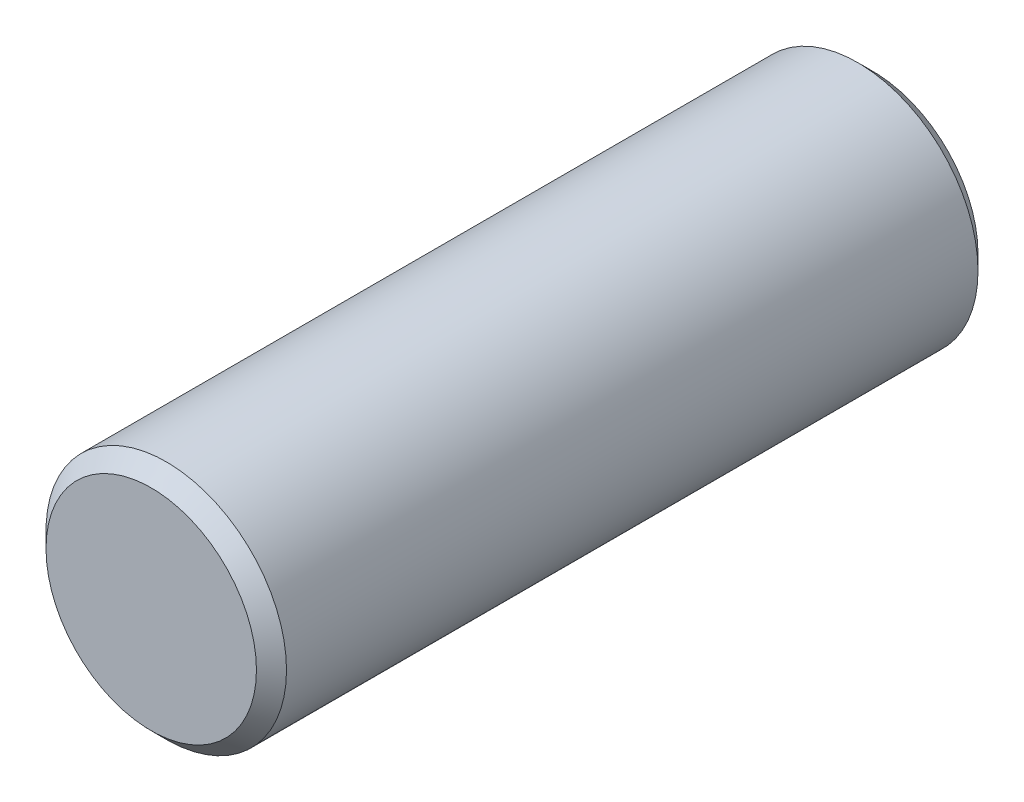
from build123d import *

# Parameters (mm, degrees)
SKETCH_1_R      = 2
EXTRUDE_1_DEPTH = 12
CHAMFER_1_SIZE  = 0.25


with BuildPart() as part:
    # Sketch 1 → Extrude 1 (new body)
    with BuildSketch(Plane.XY):
        Circle(SKETCH_1_R)
    extrude(amount=EXTRUDE_1_DEPTH)

    # Chamfer 1
    chamfer_1_edges = [part.edges().sort_by_distance(p)[0] for p in [
        (-2, 0, 0),
        (-2, 0, 12),
    ]]
    chamfer(chamfer_1_edges, length=CHAMFER_1_SIZE)


solid = part.part
